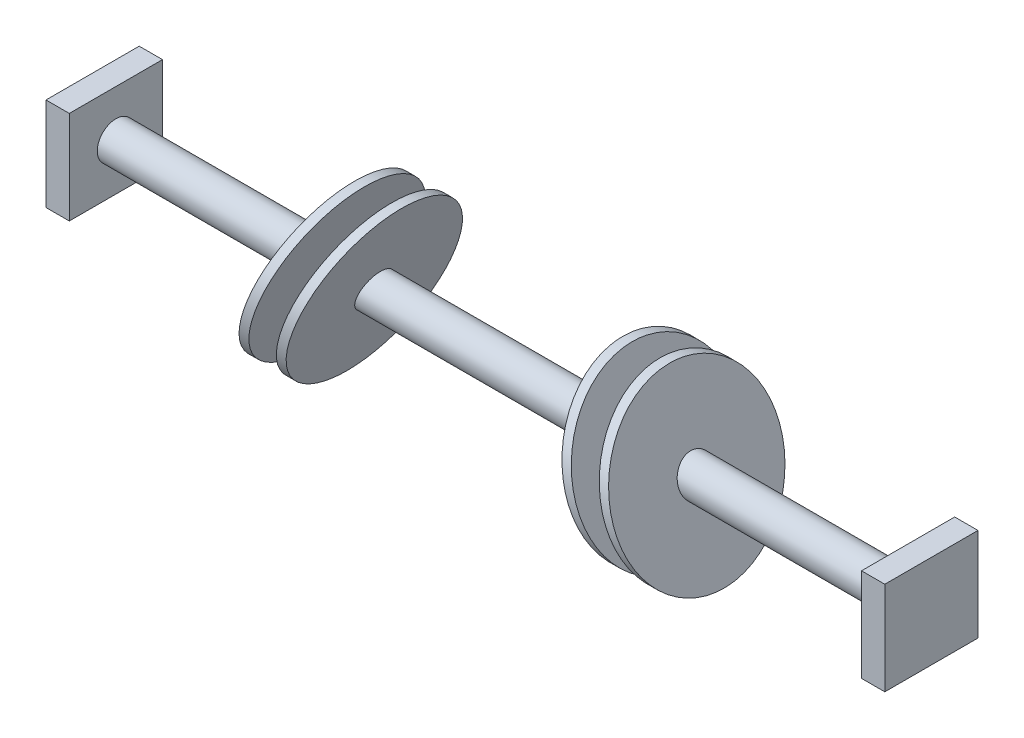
ISO-10303-21;
HEADER;
FILE_DESCRIPTION(('STEP AP214'),'2;1');
FILE_NAME('part.step','',(''),(''),'','','');
FILE_SCHEMA(('AUTOMOTIVE_DESIGN { 1 0 10303 214 1 1 1 1 }'));
ENDSEC;
DATA;
#1=APPLICATION_CONTEXT('core data for automotive mechanical design processes');
#2=APPLICATION_PROTOCOL_DEFINITION('international standard','automotive_design',2000,#1);
#3=PRODUCT_CONTEXT('',#1,'mechanical');
#4=PRODUCT('Part','Part','',(#3));
#5=PRODUCT_RELATED_PRODUCT_CATEGORY('part','',(#4));
#6=PRODUCT_DEFINITION_FORMATION('','',#4);
#7=PRODUCT_DEFINITION_CONTEXT('part definition',#1,'design');
#8=PRODUCT_DEFINITION('design','',#6,#7);
#9=PRODUCT_DEFINITION_SHAPE('','',#8);
#10=(LENGTH_UNIT() NAMED_UNIT(*) SI_UNIT(.MILLI.,.METRE.));
#11=(NAMED_UNIT(*) PLANE_ANGLE_UNIT() SI_UNIT($,.RADIAN.));
#12=(NAMED_UNIT(*) SI_UNIT($,.STERADIAN.) SOLID_ANGLE_UNIT());
#13=UNCERTAINTY_MEASURE_WITH_UNIT(LENGTH_MEASURE(1.E-05),#10,'distance_accuracy_value','');
#14=(GEOMETRIC_REPRESENTATION_CONTEXT(3) GLOBAL_UNCERTAINTY_ASSIGNED_CONTEXT((#13)) GLOBAL_UNIT_ASSIGNED_CONTEXT((#10,
#11,#12)) REPRESENTATION_CONTEXT('',''));
#15=CARTESIAN_POINT('',(0.,0.,0.));
#16=DIRECTION('',(0.,0.,1.));
#17=DIRECTION('',(1.,0.,0.));
#18=AXIS2_PLACEMENT_3D('',#15,#16,#17);
#19=CARTESIAN_POINT('',(50.,0.,0.));
#20=DIRECTION('',(-1.,0.,0.));
#21=DIRECTION('',(0.,0.,1.));
#22=AXIS2_PLACEMENT_3D('',#19,#20,#21);
#23=CYLINDRICAL_SURFACE('',#22,2.);
#24=CARTESIAN_POINT('',(44.8257311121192,0.,0.));
#25=DIRECTION('',(0.951056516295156,0.309016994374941,0.));
#26=DIRECTION('',(-0.309016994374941,0.951056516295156,0.));
#27=AXIS2_PLACEMENT_3D('',#24,#25,#26);
#28=ELLIPSE('',#27,2.10292444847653,2.);
#29=CARTESIAN_POINT('',(44.1758917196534,2.,0.));
#30=VERTEX_POINT('',#29);
#31=EDGE_CURVE('E290',#30,#30,#28,.T.);
#32=ORIENTED_EDGE('',*,*,#31,.T.);
#33=EDGE_LOOP('',(#32));
#34=FACE_BOUND('',#33,.T.);
#35=CARTESIAN_POINT('',(67.5,0.,0.));
#36=DIRECTION('',(1.,0.,0.));
#37=DIRECTION('',(0.,0.,-1.));
#38=AXIS2_PLACEMENT_3D('',#35,#36,#37);
#39=CIRCLE('',#38,2.);
#40=CARTESIAN_POINT('',(67.5,0.,-2.));
#41=VERTEX_POINT('',#40);
#42=EDGE_CURVE('E12',#41,#41,#39,.T.);
#43=ORIENTED_EDGE('',*,*,#42,.F.);
#44=EDGE_LOOP('',(#43));
#45=FACE_BOUND('',#44,.T.);
#46=ADVANCED_FACE('F95',(#34,#45),#23,.T.);
#47=CARTESIAN_POINT('',(5.17426888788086,0.,0.));
#48=DIRECTION('',(-0.951056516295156,0.309016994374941,0.));
#49=DIRECTION('',(-0.309016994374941,-0.951056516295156,0.));
#50=AXIS2_PLACEMENT_3D('',#47,#48,#49);
#51=ELLIPSE('',#50,2.10292444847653,2.);
#52=CARTESIAN_POINT('',(4.52442949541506,-2.,0.));
#53=VERTEX_POINT('',#52);
#54=EDGE_CURVE('E289',#53,#53,#51,.T.);
#55=ORIENTED_EDGE('',*,*,#54,.T.);
#56=EDGE_LOOP('',(#55));
#57=FACE_BOUND('',#56,.T.);
#58=CARTESIAN_POINT('',(-17.5,0.,0.));
#59=DIRECTION('',(-1.,0.,0.));
#60=DIRECTION('',(0.,0.,1.));
#61=AXIS2_PLACEMENT_3D('',#58,#59,#60);
#62=CIRCLE('',#61,2.);
#63=CARTESIAN_POINT('',(-17.5,0.,2.));
#64=VERTEX_POINT('',#63);
#65=EDGE_CURVE('E104',#64,#64,#62,.T.);
#66=ORIENTED_EDGE('',*,*,#65,.F.);
#67=EDGE_LOOP('',(#66));
#68=FACE_BOUND('',#67,.T.);
#69=ADVANCED_FACE('F330',(#57,#68),#23,.T.);
#70=CARTESIAN_POINT('',(40.5452546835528,13.1739518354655,-10.));
#71=DIRECTION('',(0.951056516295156,0.309016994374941,0.));
#72=DIRECTION('',(-0.309016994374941,0.951056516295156,0.));
#73=AXIS2_PLACEMENT_3D('',#70,#71,#72);
#74=PLANE('',#73);
#75=ORIENTED_EDGE('',*,*,#31,.F.);
#76=EDGE_LOOP('',(#75));
#77=FACE_BOUND('',#76,.T.);
#78=CARTESIAN_POINT('',(44.8257311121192,0.,0.));
#79=DIRECTION('',(0.951056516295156,0.309016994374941,0.));
#80=DIRECTION('',(-0.309016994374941,0.951056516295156,0.));
#81=AXIS2_PLACEMENT_3D('',#78,#79,#80);
#82=ELLIPSE('',#81,9.46316001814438,9.);
#83=CARTESIAN_POINT('',(41.9014538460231,9.,0.));
#84=VERTEX_POINT('',#83);
#85=EDGE_CURVE('E281',#84,#84,#82,.T.);
#86=ORIENTED_EDGE('',*,*,#85,.T.);
#87=EDGE_LOOP('',(#86));
#88=FACE_BOUND('',#87,.T.);
#89=ADVANCED_FACE('F332',(#77,#88),#74,.T.);
#90=CARTESIAN_POINT('',(50.,0.,0.));
#91=DIRECTION('',(-1.,0.,0.));
#92=DIRECTION('',(0.,0.,1.));
#93=AXIS2_PLACEMENT_3D('',#90,#91,#92);
#94=CYLINDRICAL_SURFACE('',#93,9.);
#95=CARTESIAN_POINT('',(43.8257311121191,0.,0.));
#96=DIRECTION('',(-0.951056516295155,-0.309016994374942,0.));
#97=DIRECTION('',(-0.309016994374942,0.951056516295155,0.));
#98=AXIS2_PLACEMENT_3D('',#95,#96,#97);
#99=ELLIPSE('',#98,9.46316001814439,9.);
#100=CARTESIAN_POINT('',(40.901453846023,9.,0.));
#101=VERTEX_POINT('',#100);
#102=EDGE_CURVE('E285',#101,#101,#99,.T.);
#103=ORIENTED_EDGE('',*,*,#102,.F.);
#104=EDGE_LOOP('',(#103));
#105=FACE_BOUND('',#104,.T.);
#106=ORIENTED_EDGE('',*,*,#85,.F.);
#107=EDGE_LOOP('',(#106));
#108=FACE_BOUND('',#107,.T.);
#109=ADVANCED_FACE('F340',(#105,#108),#94,.T.);
#110=CARTESIAN_POINT('',(39.6407461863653,12.8800592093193,-10.));
#111=DIRECTION('',(-0.951056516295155,-0.309016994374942,0.));
#112=DIRECTION('',(0.309016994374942,-0.951056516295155,0.));
#113=AXIS2_PLACEMENT_3D('',#110,#111,#112);
#114=PLANE('',#113);
#115=CARTESIAN_POINT('',(43.8257311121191,0.,0.));
#116=DIRECTION('',(-0.951056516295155,-0.309016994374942,0.));
#117=DIRECTION('',(-0.309016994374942,0.951056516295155,0.));
#118=AXIS2_PLACEMENT_3D('',#115,#116,#117);
#119=ELLIPSE('',#118,2.10292444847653,2.);
#120=CARTESIAN_POINT('',(43.1758917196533,2.,0.));
#121=VERTEX_POINT('',#120);
#122=EDGE_CURVE('E294',#121,#121,#119,.T.);
#123=ORIENTED_EDGE('',*,*,#122,.F.);
#124=EDGE_LOOP('',(#123));
#125=FACE_BOUND('',#124,.T.);
#126=ORIENTED_EDGE('',*,*,#102,.T.);
#127=EDGE_LOOP('',(#126));
#128=FACE_BOUND('',#127,.T.);
#129=ADVANCED_FACE('F365',(#125,#128),#114,.T.);
#130=CARTESIAN_POINT('',(40.8257311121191,0.,0.));
#131=DIRECTION('',(0.951056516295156,0.309016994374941,0.));
#132=DIRECTION('',(-0.309016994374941,0.951056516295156,0.));
#133=AXIS2_PLACEMENT_3D('',#130,#131,#132);
#134=ELLIPSE('',#133,2.10292444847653,2.);
#135=CARTESIAN_POINT('',(40.1758917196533,2.,0.));
#136=VERTEX_POINT('',#135);
#137=EDGE_CURVE('E295',#136,#136,#134,.T.);
#138=ORIENTED_EDGE('',*,*,#137,.T.);
#139=EDGE_LOOP('',(#138));
#140=FACE_BOUND('',#139,.T.);
#141=ORIENTED_EDGE('',*,*,#122,.T.);
#142=EDGE_LOOP('',(#141));
#143=FACE_BOUND('',#142,.T.);
#144=ADVANCED_FACE('F350',(#140,#143),#23,.T.);
#145=CARTESIAN_POINT('',(36.9272206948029,11.9983813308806,-10.));
#146=DIRECTION('',(0.951056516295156,0.309016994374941,0.));
#147=DIRECTION('',(-0.309016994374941,0.951056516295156,0.));
#148=AXIS2_PLACEMENT_3D('',#145,#146,#147);
#149=PLANE('',#148);
#150=ORIENTED_EDGE('',*,*,#137,.F.);
#151=EDGE_LOOP('',(#150));
#152=FACE_BOUND('',#151,.T.);
#153=CARTESIAN_POINT('',(40.8257311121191,0.,0.));
#154=DIRECTION('',(0.951056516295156,0.309016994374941,0.));
#155=DIRECTION('',(-0.309016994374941,0.951056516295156,0.));
#156=AXIS2_PLACEMENT_3D('',#153,#154,#155);
#157=ELLIPSE('',#156,9.46316001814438,9.);
#158=CARTESIAN_POINT('',(37.901453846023,9.,0.));
#159=VERTEX_POINT('',#158);
#160=EDGE_CURVE('E277',#159,#159,#157,.T.);
#161=ORIENTED_EDGE('',*,*,#160,.T.);
#162=EDGE_LOOP('',(#161));
#163=FACE_BOUND('',#162,.T.);
#164=ADVANCED_FACE('F364',(#152,#163),#149,.T.);
#165=ORIENTED_EDGE('',*,*,#160,.F.);
#166=EDGE_LOOP('',(#165));
#167=FACE_BOUND('',#166,.T.);
#168=CARTESIAN_POINT('',(39.8257311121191,0.,0.));
#169=DIRECTION('',(-0.951056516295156,-0.309016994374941,0.));
#170=DIRECTION('',(-0.309016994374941,0.951056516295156,0.));
#171=AXIS2_PLACEMENT_3D('',#168,#169,#170);
#172=ELLIPSE('',#171,9.46316001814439,9.);
#173=CARTESIAN_POINT('',(36.901453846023,9.,0.));
#174=VERTEX_POINT('',#173);
#175=EDGE_CURVE('E273',#174,#174,#172,.T.);
#176=ORIENTED_EDGE('',*,*,#175,.F.);
#177=EDGE_LOOP('',(#176));
#178=FACE_BOUND('',#177,.T.);
#179=ADVANCED_FACE('F370',(#167,#178),#94,.T.);
#180=CARTESIAN_POINT('',(36.0227121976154,11.7044887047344,-10.));
#181=DIRECTION('',(-0.951056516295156,-0.309016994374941,0.));
#182=DIRECTION('',(0.309016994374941,-0.951056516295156,0.));
#183=AXIS2_PLACEMENT_3D('',#180,#181,#182);
#184=PLANE('',#183);
#185=CARTESIAN_POINT('',(39.8257311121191,0.,0.));
#186=DIRECTION('',(-0.951056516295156,-0.309016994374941,0.));
#187=DIRECTION('',(-0.309016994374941,0.951056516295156,0.));
#188=AXIS2_PLACEMENT_3D('',#185,#186,#187);
#189=ELLIPSE('',#188,2.10292444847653,2.);
#190=CARTESIAN_POINT('',(39.1758917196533,2.,0.));
#191=VERTEX_POINT('',#190);
#192=EDGE_CURVE('E300',#191,#191,#189,.T.);
#193=ORIENTED_EDGE('',*,*,#192,.F.);
#194=EDGE_LOOP('',(#193));
#195=FACE_BOUND('',#194,.T.);
#196=ORIENTED_EDGE('',*,*,#175,.T.);
#197=EDGE_LOOP('',(#196));
#198=FACE_BOUND('',#197,.T.);
#199=ADVANCED_FACE('F377',(#195,#198),#184,.T.);
#200=CARTESIAN_POINT('',(10.2257311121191,0.,0.));
#201=DIRECTION('',(0.951056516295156,-0.309016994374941,0.));
#202=DIRECTION('',(-0.309016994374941,-0.951056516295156,0.));
#203=AXIS2_PLACEMENT_3D('',#200,#201,#202);
#204=ELLIPSE('',#203,2.10292444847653,2.);
#205=CARTESIAN_POINT('',(9.57589171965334,-2.,0.));
#206=VERTEX_POINT('',#205);
#207=EDGE_CURVE('E304',#206,#206,#204,.T.);
#208=ORIENTED_EDGE('',*,*,#207,.T.);
#209=EDGE_LOOP('',(#208));
#210=FACE_BOUND('',#209,.T.);
#211=ORIENTED_EDGE('',*,*,#192,.T.);
#212=EDGE_LOOP('',(#211));
#213=FACE_BOUND('',#212,.T.);
#214=ADVANCED_FACE('F345',(#210,#213),#23,.T.);
#215=CARTESIAN_POINT('',(9.24926068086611,-3.00526697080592,-10.));
#216=DIRECTION('',(0.951056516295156,-0.309016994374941,0.));
#217=DIRECTION('',(0.309016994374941,0.951056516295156,0.));
#218=AXIS2_PLACEMENT_3D('',#215,#216,#217);
#219=PLANE('',#218);
#220=ORIENTED_EDGE('',*,*,#207,.F.);
#221=EDGE_LOOP('',(#220));
#222=FACE_BOUND('',#221,.T.);
#223=CARTESIAN_POINT('',(10.2257311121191,0.,0.));
#224=DIRECTION('',(0.951056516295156,-0.309016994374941,0.));
#225=DIRECTION('',(-0.309016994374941,-0.951056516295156,0.));
#226=AXIS2_PLACEMENT_3D('',#223,#224,#225);
#227=ELLIPSE('',#226,9.46316001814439,9.);
#228=CARTESIAN_POINT('',(7.30145384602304,-9.,0.));
#229=VERTEX_POINT('',#228);
#230=EDGE_CURVE('E269',#229,#229,#227,.T.);
#231=ORIENTED_EDGE('',*,*,#230,.T.);
#232=EDGE_LOOP('',(#231));
#233=FACE_BOUND('',#232,.T.);
#234=ADVANCED_FACE('F376',(#222,#233),#219,.T.);
#235=ORIENTED_EDGE('',*,*,#230,.F.);
#236=EDGE_LOOP('',(#235));
#237=FACE_BOUND('',#236,.T.);
#238=CARTESIAN_POINT('',(9.17426888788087,0.,0.));
#239=DIRECTION('',(0.951056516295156,-0.309016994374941,0.));
#240=DIRECTION('',(-0.309016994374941,-0.951056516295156,0.));
#241=AXIS2_PLACEMENT_3D('',#238,#239,#240);
#242=ELLIPSE('',#241,9.46316001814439,9.);
#243=CARTESIAN_POINT('',(6.24999162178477,-9.,0.));
#244=VERTEX_POINT('',#243);
#245=EDGE_CURVE('E265',#244,#244,#242,.T.);
#246=ORIENTED_EDGE('',*,*,#245,.T.);
#247=EDGE_LOOP('',(#246));
#248=FACE_BOUND('',#247,.T.);
#249=ADVANCED_FACE('F359',(#237,#248),#94,.T.);
#250=CARTESIAN_POINT('',(8.29820416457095,-2.69624997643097,-10.));
#251=DIRECTION('',(0.951056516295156,-0.309016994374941,0.));
#252=DIRECTION('',(0.309016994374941,0.951056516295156,0.));
#253=AXIS2_PLACEMENT_3D('',#250,#251,#252);
#254=PLANE('',#253);
#255=CARTESIAN_POINT('',(9.17426888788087,0.,0.));
#256=DIRECTION('',(0.951056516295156,-0.309016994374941,0.));
#257=DIRECTION('',(-0.309016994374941,-0.951056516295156,0.));
#258=AXIS2_PLACEMENT_3D('',#255,#256,#257);
#259=ELLIPSE('',#258,2.10292444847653,2.);
#260=CARTESIAN_POINT('',(8.52442949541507,-2.,0.));
#261=VERTEX_POINT('',#260);
#262=EDGE_CURVE('E299',#261,#261,#259,.T.);
#263=ORIENTED_EDGE('',*,*,#262,.T.);
#264=EDGE_LOOP('',(#263));
#265=FACE_BOUND('',#264,.T.);
#266=ORIENTED_EDGE('',*,*,#245,.F.);
#267=EDGE_LOOP('',(#266));
#268=FACE_BOUND('',#267,.T.);
#269=ADVANCED_FACE('F348',(#265,#268),#254,.F.);
#270=CARTESIAN_POINT('',(6.22573111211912,0.,0.));
#271=DIRECTION('',(0.951056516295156,-0.309016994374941,0.));
#272=DIRECTION('',(-0.309016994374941,-0.951056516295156,0.));
#273=AXIS2_PLACEMENT_3D('',#270,#271,#272);
#274=ELLIPSE('',#273,2.10292444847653,2.);
#275=CARTESIAN_POINT('',(5.57589171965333,-2.,0.));
#276=VERTEX_POINT('',#275);
#277=EDGE_CURVE('E314',#276,#276,#274,.T.);
#278=ORIENTED_EDGE('',*,*,#277,.T.);
#279=EDGE_LOOP('',(#278));
#280=FACE_BOUND('',#279,.T.);
#281=ORIENTED_EDGE('',*,*,#262,.F.);
#282=EDGE_LOOP('',(#281));
#283=FACE_BOUND('',#282,.T.);
#284=ADVANCED_FACE('F334',(#280,#283),#23,.T.);
#285=CARTESIAN_POINT('',(9.28962929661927,9.42970900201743,-10.));
#286=DIRECTION('',(0.951056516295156,-0.309016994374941,0.));
#287=DIRECTION('',(0.309016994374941,0.951056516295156,0.));
#288=AXIS2_PLACEMENT_3D('',#285,#286,#287);
#289=PLANE('',#288);
#290=ORIENTED_EDGE('',*,*,#277,.F.);
#291=EDGE_LOOP('',(#290));
#292=FACE_BOUND('',#291,.T.);
#293=CARTESIAN_POINT('',(6.22573111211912,0.,0.));
#294=DIRECTION('',(0.951056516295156,-0.309016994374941,0.));
#295=DIRECTION('',(-0.309016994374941,-0.951056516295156,0.));
#296=AXIS2_PLACEMENT_3D('',#293,#294,#295);
#297=ELLIPSE('',#296,9.46316001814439,9.);
#298=CARTESIAN_POINT('',(3.30145384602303,-9.,0.));
#299=VERTEX_POINT('',#298);
#300=EDGE_CURVE('E261',#299,#299,#297,.T.);
#301=ORIENTED_EDGE('',*,*,#300,.T.);
#302=EDGE_LOOP('',(#301));
#303=FACE_BOUND('',#302,.T.);
#304=ADVANCED_FACE('F347',(#292,#303),#289,.T.);
#305=ORIENTED_EDGE('',*,*,#300,.F.);
#306=EDGE_LOOP('',(#305));
#307=FACE_BOUND('',#306,.T.);
#308=CARTESIAN_POINT('',(5.17426888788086,0.,0.));
#309=DIRECTION('',(-0.951056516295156,0.309016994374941,0.));
#310=DIRECTION('',(-0.309016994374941,-0.951056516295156,0.));
#311=AXIS2_PLACEMENT_3D('',#308,#309,#310);
#312=ELLIPSE('',#311,9.46316001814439,9.);
#313=CARTESIAN_POINT('',(2.24999162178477,-9.,0.));
#314=VERTEX_POINT('',#313);
#315=EDGE_CURVE('E253',#314,#314,#312,.T.);
#316=ORIENTED_EDGE('',*,*,#315,.F.);
#317=EDGE_LOOP('',(#316));
#318=FACE_BOUND('',#317,.T.);
#319=ADVANCED_FACE('F355',(#307,#318),#94,.T.);
#320=CARTESIAN_POINT('',(2.11037070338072,-9.42970900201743,-10.));
#321=DIRECTION('',(-0.951056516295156,0.309016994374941,0.));
#322=DIRECTION('',(-0.309016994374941,-0.951056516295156,0.));
#323=AXIS2_PLACEMENT_3D('',#320,#321,#322);
#324=PLANE('',#323);
#325=ORIENTED_EDGE('',*,*,#54,.F.);
#326=EDGE_LOOP('',(#325));
#327=FACE_BOUND('',#326,.T.);
#328=ORIENTED_EDGE('',*,*,#315,.T.);
#329=EDGE_LOOP('',(#328));
#330=FACE_BOUND('',#329,.T.);
#331=ADVANCED_FACE('F409',(#327,#330),#324,.T.);
#332=CARTESIAN_POINT('',(-17.5,5.,5.));
#333=DIRECTION('',(0.,0.,1.));
#334=DIRECTION('',(0.,-1.,0.));
#335=AXIS2_PLACEMENT_3D('',#332,#333,#334);
#336=PLANE('',#335);
#337=DIRECTION('',(0.,1.,0.));
#338=VECTOR('',#337,1.);
#339=CARTESIAN_POINT('',(-20.,5.,5.));
#340=LINE('',#339,#338);
#341=CARTESIAN_POINT('',(-20.,-5.,5.));
#342=VERTEX_POINT('',#341);
#343=CARTESIAN_POINT('',(-20.,5.,5.));
#344=VERTEX_POINT('',#343);
#345=EDGE_CURVE('E219',#342,#344,#340,.T.);
#346=ORIENTED_EDGE('',*,*,#345,.F.);
#347=DIRECTION('',(-1.,0.,0.));
#348=VECTOR('',#347,1.);
#349=CARTESIAN_POINT('',(-17.5,-5.,5.));
#350=LINE('',#349,#348);
#351=CARTESIAN_POINT('',(-17.5,-5.,5.));
#352=VERTEX_POINT('',#351);
#353=EDGE_CURVE('E112',#352,#342,#350,.T.);
#354=ORIENTED_EDGE('',*,*,#353,.F.);
#355=DIRECTION('',(0.,1.,0.));
#356=VECTOR('',#355,1.);
#357=CARTESIAN_POINT('',(-17.5,5.,5.));
#358=LINE('',#357,#356);
#359=CARTESIAN_POINT('',(-17.5,5.,5.));
#360=VERTEX_POINT('',#359);
#361=EDGE_CURVE('E225',#352,#360,#358,.T.);
#362=ORIENTED_EDGE('',*,*,#361,.T.);
#363=DIRECTION('',(-1.,0.,0.));
#364=VECTOR('',#363,1.);
#365=CARTESIAN_POINT('',(-17.5,5.,5.));
#366=LINE('',#365,#364);
#367=EDGE_CURVE('E141',#360,#344,#366,.T.);
#368=ORIENTED_EDGE('',*,*,#367,.T.);
#369=EDGE_LOOP('',(#346,#354,#362,#368));
#370=FACE_BOUND('',#369,.T.);
#371=ADVANCED_FACE('F413',(#370),#336,.T.);
#372=CARTESIAN_POINT('',(-17.5,-5.,-5.));
#373=DIRECTION('',(0.,-1.,0.));
#374=DIRECTION('',(0.,0.,-1.));
#375=AXIS2_PLACEMENT_3D('',#372,#373,#374);
#376=PLANE('',#375);
#377=DIRECTION('',(0.,0.,1.));
#378=VECTOR('',#377,1.);
#379=CARTESIAN_POINT('',(-20.,-5.,-5.));
#380=LINE('',#379,#378);
#381=CARTESIAN_POINT('',(-20.,-5.,-5.));
#382=VERTEX_POINT('',#381);
#383=EDGE_CURVE('E229',#382,#342,#380,.T.);
#384=ORIENTED_EDGE('',*,*,#383,.F.);
#385=DIRECTION('',(-1.,0.,0.));
#386=VECTOR('',#385,1.);
#387=CARTESIAN_POINT('',(-17.5,-5.,-5.));
#388=LINE('',#387,#386);
#389=CARTESIAN_POINT('',(-17.5,-5.,-5.));
#390=VERTEX_POINT('',#389);
#391=EDGE_CURVE('E130',#390,#382,#388,.T.);
#392=ORIENTED_EDGE('',*,*,#391,.F.);
#393=DIRECTION('',(0.,0.,1.));
#394=VECTOR('',#393,1.);
#395=CARTESIAN_POINT('',(-17.5,-5.,-5.));
#396=LINE('',#395,#394);
#397=EDGE_CURVE('E235',#390,#352,#396,.T.);
#398=ORIENTED_EDGE('',*,*,#397,.T.);
#399=ORIENTED_EDGE('',*,*,#353,.T.);
#400=EDGE_LOOP('',(#384,#392,#398,#399));
#401=FACE_BOUND('',#400,.T.);
#402=ADVANCED_FACE('F423',(#401),#376,.T.);
#403=CARTESIAN_POINT('',(-17.5,5.,-5.));
#404=DIRECTION('',(0.,0.,-1.));
#405=DIRECTION('',(0.,1.,0.));
#406=AXIS2_PLACEMENT_3D('',#403,#404,#405);
#407=PLANE('',#406);
#408=DIRECTION('',(0.,-1.,0.));
#409=VECTOR('',#408,1.);
#410=CARTESIAN_POINT('',(-20.,5.,-5.));
#411=LINE('',#410,#409);
#412=CARTESIAN_POINT('',(-20.,5.,-5.));
#413=VERTEX_POINT('',#412);
#414=EDGE_CURVE('E245',#413,#382,#411,.T.);
#415=ORIENTED_EDGE('',*,*,#414,.F.);
#416=DIRECTION('',(-1.,0.,0.));
#417=VECTOR('',#416,1.);
#418=CARTESIAN_POINT('',(-17.5,5.,-5.));
#419=LINE('',#418,#417);
#420=CARTESIAN_POINT('',(-17.5,5.,-5.));
#421=VERTEX_POINT('',#420);
#422=EDGE_CURVE('E256',#421,#413,#419,.T.);
#423=ORIENTED_EDGE('',*,*,#422,.F.);
#424=DIRECTION('',(0.,-1.,0.));
#425=VECTOR('',#424,1.);
#426=CARTESIAN_POINT('',(-17.5,5.,-5.));
#427=LINE('',#426,#425);
#428=EDGE_CURVE('E232',#421,#390,#427,.T.);
#429=ORIENTED_EDGE('',*,*,#428,.T.);
#430=ORIENTED_EDGE('',*,*,#391,.T.);
#431=EDGE_LOOP('',(#415,#423,#429,#430));
#432=FACE_BOUND('',#431,.T.);
#433=ADVANCED_FACE('F429',(#432),#407,.T.);
#434=CARTESIAN_POINT('',(-17.5,5.,-5.));
#435=DIRECTION('',(0.,1.,0.));
#436=DIRECTION('',(0.,0.,1.));
#437=AXIS2_PLACEMENT_3D('',#434,#435,#436);
#438=PLANE('',#437);
#439=DIRECTION('',(0.,0.,-1.));
#440=VECTOR('',#439,1.);
#441=CARTESIAN_POINT('',(-20.,5.,-5.));
#442=LINE('',#441,#440);
#443=EDGE_CURVE('E241',#344,#413,#442,.T.);
#444=ORIENTED_EDGE('',*,*,#443,.F.);
#445=ORIENTED_EDGE('',*,*,#367,.F.);
#446=DIRECTION('',(0.,0.,-1.));
#447=VECTOR('',#446,1.);
#448=CARTESIAN_POINT('',(-17.5,5.,-5.));
#449=LINE('',#448,#447);
#450=EDGE_CURVE('E228',#360,#421,#449,.T.);
#451=ORIENTED_EDGE('',*,*,#450,.T.);
#452=ORIENTED_EDGE('',*,*,#422,.T.);
#453=EDGE_LOOP('',(#444,#445,#451,#452));
#454=FACE_BOUND('',#453,.T.);
#455=ADVANCED_FACE('F433',(#454),#438,.T.);
#456=CARTESIAN_POINT('',(-17.5,0.,0.));
#457=DIRECTION('',(-1.,0.,0.));
#458=DIRECTION('',(0.,0.,1.));
#459=AXIS2_PLACEMENT_3D('',#456,#457,#458);
#460=PLANE('',#459);
#461=ORIENTED_EDGE('',*,*,#65,.T.);
#462=EDGE_LOOP('',(#461));
#463=FACE_BOUND('',#462,.T.);
#464=ORIENTED_EDGE('',*,*,#361,.F.);
#465=ORIENTED_EDGE('',*,*,#397,.F.);
#466=ORIENTED_EDGE('',*,*,#428,.F.);
#467=ORIENTED_EDGE('',*,*,#450,.F.);
#468=EDGE_LOOP('',(#464,#465,#466,#467));
#469=FACE_BOUND('',#468,.T.);
#470=ADVANCED_FACE('F327',(#463,#469),#460,.F.);
#471=CARTESIAN_POINT('',(-20.,0.,0.));
#472=DIRECTION('',(-1.,0.,0.));
#473=DIRECTION('',(0.,0.,1.));
#474=AXIS2_PLACEMENT_3D('',#471,#472,#473);
#475=PLANE('',#474);
#476=ORIENTED_EDGE('',*,*,#345,.T.);
#477=ORIENTED_EDGE('',*,*,#443,.T.);
#478=ORIENTED_EDGE('',*,*,#414,.T.);
#479=ORIENTED_EDGE('',*,*,#383,.T.);
#480=EDGE_LOOP('',(#476,#477,#478,#479));
#481=FACE_BOUND('',#480,.T.);
#482=ADVANCED_FACE('F438',(#481),#475,.T.);
#483=CARTESIAN_POINT('',(67.5,-5.,-5.));
#484=DIRECTION('',(0.,0.,-1.));
#485=DIRECTION('',(0.,1.,0.));
#486=AXIS2_PLACEMENT_3D('',#483,#484,#485);
#487=PLANE('',#486);
#488=DIRECTION('',(0.,1.,0.));
#489=VECTOR('',#488,1.);
#490=CARTESIAN_POINT('',(70.,-5.,-5.));
#491=LINE('',#490,#489);
#492=CARTESIAN_POINT('',(70.,-5.,-5.));
#493=VERTEX_POINT('',#492);
#494=CARTESIAN_POINT('',(70.,5.,-5.));
#495=VERTEX_POINT('',#494);
#496=EDGE_CURVE('E209',#493,#495,#491,.T.);
#497=ORIENTED_EDGE('',*,*,#496,.F.);
#498=DIRECTION('',(1.,0.,0.));
#499=VECTOR('',#498,1.);
#500=CARTESIAN_POINT('',(67.5,-5.,-5.));
#501=LINE('',#500,#499);
#502=CARTESIAN_POINT('',(67.5,-5.,-5.));
#503=VERTEX_POINT('',#502);
#504=EDGE_CURVE('E196',#503,#493,#501,.T.);
#505=ORIENTED_EDGE('',*,*,#504,.F.);
#506=DIRECTION('',(0.,1.,0.));
#507=VECTOR('',#506,1.);
#508=CARTESIAN_POINT('',(67.5,-5.,-5.));
#509=LINE('',#508,#507);
#510=CARTESIAN_POINT('',(67.5,5.,-5.));
#511=VERTEX_POINT('',#510);
#512=EDGE_CURVE('E189',#503,#511,#509,.T.);
#513=ORIENTED_EDGE('',*,*,#512,.T.);
#514=DIRECTION('',(1.,0.,0.));
#515=VECTOR('',#514,1.);
#516=CARTESIAN_POINT('',(67.5,5.,-5.));
#517=LINE('',#516,#515);
#518=EDGE_CURVE('E170',#511,#495,#517,.T.);
#519=ORIENTED_EDGE('',*,*,#518,.T.);
#520=EDGE_LOOP('',(#497,#505,#513,#519));
#521=FACE_BOUND('',#520,.T.);
#522=ADVANCED_FACE('F195',(#521),#487,.T.);
#523=CARTESIAN_POINT('',(67.5,-5.,5.));
#524=DIRECTION('',(0.,-1.,0.));
#525=DIRECTION('',(0.,0.,-1.));
#526=AXIS2_PLACEMENT_3D('',#523,#524,#525);
#527=PLANE('',#526);
#528=DIRECTION('',(0.,0.,-1.));
#529=VECTOR('',#528,1.);
#530=CARTESIAN_POINT('',(70.,-5.,5.));
#531=LINE('',#530,#529);
#532=CARTESIAN_POINT('',(70.,-5.,5.));
#533=VERTEX_POINT('',#532);
#534=EDGE_CURVE('E198',#533,#493,#531,.T.);
#535=ORIENTED_EDGE('',*,*,#534,.F.);
#536=DIRECTION('',(1.,0.,0.));
#537=VECTOR('',#536,1.);
#538=CARTESIAN_POINT('',(67.5,-5.,5.));
#539=LINE('',#538,#537);
#540=CARTESIAN_POINT('',(67.5,-5.,5.));
#541=VERTEX_POINT('',#540);
#542=EDGE_CURVE('E220',#541,#533,#539,.T.);
#543=ORIENTED_EDGE('',*,*,#542,.F.);
#544=DIRECTION('',(0.,0.,-1.));
#545=VECTOR('',#544,1.);
#546=CARTESIAN_POINT('',(67.5,-5.,5.));
#547=LINE('',#546,#545);
#548=EDGE_CURVE('E182',#541,#503,#547,.T.);
#549=ORIENTED_EDGE('',*,*,#548,.T.);
#550=ORIENTED_EDGE('',*,*,#504,.T.);
#551=EDGE_LOOP('',(#535,#543,#549,#550));
#552=FACE_BOUND('',#551,.T.);
#553=ADVANCED_FACE('F445',(#552),#527,.T.);
#554=CARTESIAN_POINT('',(67.5,5.,5.));
#555=DIRECTION('',(0.,0.,1.));
#556=DIRECTION('',(0.,-1.,0.));
#557=AXIS2_PLACEMENT_3D('',#554,#555,#556);
#558=PLANE('',#557);
#559=DIRECTION('',(0.,-1.,0.));
#560=VECTOR('',#559,1.);
#561=CARTESIAN_POINT('',(70.,5.,5.));
#562=LINE('',#561,#560);
#563=CARTESIAN_POINT('',(70.,5.,5.));
#564=VERTEX_POINT('',#563);
#565=EDGE_CURVE('E202',#564,#533,#562,.T.);
#566=ORIENTED_EDGE('',*,*,#565,.F.);
#567=DIRECTION('',(1.,0.,0.));
#568=VECTOR('',#567,1.);
#569=CARTESIAN_POINT('',(67.5,5.,5.));
#570=LINE('',#569,#568);
#571=CARTESIAN_POINT('',(67.5,5.,5.));
#572=VERTEX_POINT('',#571);
#573=EDGE_CURVE('E181',#572,#564,#570,.T.);
#574=ORIENTED_EDGE('',*,*,#573,.F.);
#575=DIRECTION('',(0.,-1.,0.));
#576=VECTOR('',#575,1.);
#577=CARTESIAN_POINT('',(67.5,5.,5.));
#578=LINE('',#577,#576);
#579=EDGE_CURVE('E192',#572,#541,#578,.T.);
#580=ORIENTED_EDGE('',*,*,#579,.T.);
#581=ORIENTED_EDGE('',*,*,#542,.T.);
#582=EDGE_LOOP('',(#566,#574,#580,#581));
#583=FACE_BOUND('',#582,.T.);
#584=ADVANCED_FACE('F457',(#583),#558,.T.);
#585=CARTESIAN_POINT('',(67.5,5.,-5.));
#586=DIRECTION('',(0.,1.,0.));
#587=DIRECTION('',(0.,0.,1.));
#588=AXIS2_PLACEMENT_3D('',#585,#586,#587);
#589=PLANE('',#588);
#590=DIRECTION('',(0.,0.,1.));
#591=VECTOR('',#590,1.);
#592=CARTESIAN_POINT('',(70.,5.,-5.));
#593=LINE('',#592,#591);
#594=EDGE_CURVE('E175',#495,#564,#593,.T.);
#595=ORIENTED_EDGE('',*,*,#594,.F.);
#596=ORIENTED_EDGE('',*,*,#518,.F.);
#597=DIRECTION('',(0.,0.,1.));
#598=VECTOR('',#597,1.);
#599=CARTESIAN_POINT('',(67.5,5.,-5.));
#600=LINE('',#599,#598);
#601=EDGE_CURVE('E173',#511,#572,#600,.T.);
#602=ORIENTED_EDGE('',*,*,#601,.T.);
#603=ORIENTED_EDGE('',*,*,#573,.T.);
#604=EDGE_LOOP('',(#595,#596,#602,#603));
#605=FACE_BOUND('',#604,.T.);
#606=ADVANCED_FACE('F172',(#605),#589,.T.);
#607=CARTESIAN_POINT('',(67.5,0.,0.));
#608=DIRECTION('',(1.,0.,0.));
#609=DIRECTION('',(0.,0.,-1.));
#610=AXIS2_PLACEMENT_3D('',#607,#608,#609);
#611=PLANE('',#610);
#612=ORIENTED_EDGE('',*,*,#42,.T.);
#613=EDGE_LOOP('',(#612));
#614=FACE_BOUND('',#613,.T.);
#615=ORIENTED_EDGE('',*,*,#512,.F.);
#616=ORIENTED_EDGE('',*,*,#548,.F.);
#617=ORIENTED_EDGE('',*,*,#579,.F.);
#618=ORIENTED_EDGE('',*,*,#601,.F.);
#619=EDGE_LOOP('',(#615,#616,#617,#618));
#620=FACE_BOUND('',#619,.T.);
#621=ADVANCED_FACE('F187',(#614,#620),#611,.F.);
#622=CARTESIAN_POINT('',(70.,0.,0.));
#623=DIRECTION('',(1.,0.,0.));
#624=DIRECTION('',(0.,0.,-1.));
#625=AXIS2_PLACEMENT_3D('',#622,#623,#624);
#626=PLANE('',#625);
#627=ORIENTED_EDGE('',*,*,#496,.T.);
#628=ORIENTED_EDGE('',*,*,#594,.T.);
#629=ORIENTED_EDGE('',*,*,#565,.T.);
#630=ORIENTED_EDGE('',*,*,#534,.T.);
#631=EDGE_LOOP('',(#627,#628,#629,#630));
#632=FACE_BOUND('',#631,.T.);
#633=ADVANCED_FACE('F435',(#632),#626,.T.);
#634=CLOSED_SHELL('',(#46,#69,#89,#109,#129,#144,#164,#179,#199,#214,#234,#249,#269,#284,#304,
#319,#331,#371,#402,#433,#455,#470,#482,#522,#553,#584,#606,#621,#633));
#635=MANIFOLD_SOLID_BREP('B2',#634);
#636=ADVANCED_BREP_SHAPE_REPRESENTATION('',(#18,#635),#14);
#637=SHAPE_DEFINITION_REPRESENTATION(#9,#636);
ENDSEC;
END-ISO-10303-21;
